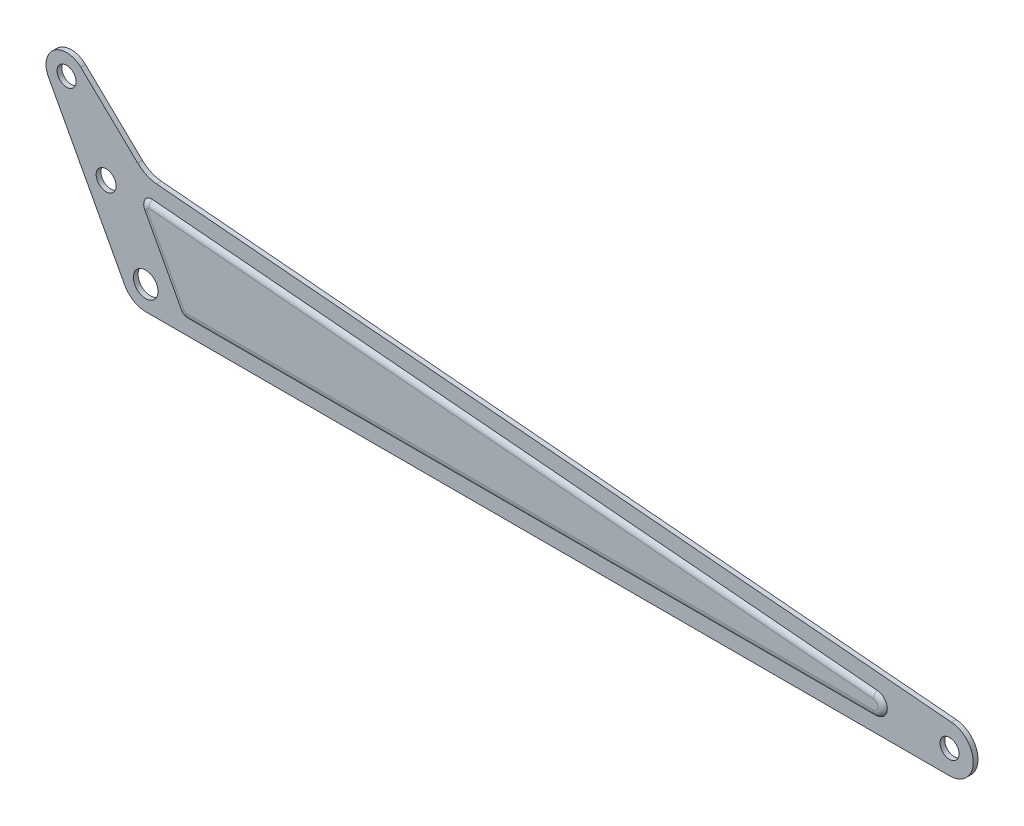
ISO-10303-21;
HEADER;
FILE_DESCRIPTION(('STEP AP214'),'2;1');
FILE_NAME('part.step','',(''),(''),'','','');
FILE_SCHEMA(('AUTOMOTIVE_DESIGN { 1 0 10303 214 1 1 1 1 }'));
ENDSEC;
DATA;
#1=APPLICATION_CONTEXT('core data for automotive mechanical design processes');
#2=APPLICATION_PROTOCOL_DEFINITION('international standard','automotive_design',2000,#1);
#3=PRODUCT_CONTEXT('',#1,'mechanical');
#4=PRODUCT('Part','Part','',(#3));
#5=PRODUCT_RELATED_PRODUCT_CATEGORY('part','',(#4));
#6=PRODUCT_DEFINITION_FORMATION('','',#4);
#7=PRODUCT_DEFINITION_CONTEXT('part definition',#1,'design');
#8=PRODUCT_DEFINITION('design','',#6,#7);
#9=PRODUCT_DEFINITION_SHAPE('','',#8);
#10=(LENGTH_UNIT() NAMED_UNIT(*) SI_UNIT(.MILLI.,.METRE.));
#11=(NAMED_UNIT(*) PLANE_ANGLE_UNIT() SI_UNIT($,.RADIAN.));
#12=(NAMED_UNIT(*) SI_UNIT($,.STERADIAN.) SOLID_ANGLE_UNIT());
#13=UNCERTAINTY_MEASURE_WITH_UNIT(LENGTH_MEASURE(1.E-05),#10,'distance_accuracy_value','');
#14=(GEOMETRIC_REPRESENTATION_CONTEXT(3) GLOBAL_UNCERTAINTY_ASSIGNED_CONTEXT((#13)) GLOBAL_UNIT_ASSIGNED_CONTEXT((#10,
#11,#12)) REPRESENTATION_CONTEXT('',''));
#15=CARTESIAN_POINT('',(0.,0.,0.));
#16=DIRECTION('',(0.,0.,1.));
#17=DIRECTION('',(1.,0.,0.));
#18=AXIS2_PLACEMENT_3D('',#15,#16,#17);
#19=CARTESIAN_POINT('',(254.,0.,1.5));
#20=DIRECTION('',(0.,0.,1.));
#21=DIRECTION('',(1.,0.,0.));
#22=AXIS2_PLACEMENT_3D('',#19,#20,#21);
#23=PLANE('',#22);
#24=CARTESIAN_POINT('',(-25.,44.4522215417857,1.5));
#25=DIRECTION('',(0.,0.,1.));
#26=DIRECTION('',(1.,0.,0.));
#27=AXIS2_PLACEMENT_3D('',#24,#25,#26);
#28=CIRCLE('',#27,3.);
#29=CARTESIAN_POINT('',(-22.,44.4522215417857,1.5));
#30=VERTEX_POINT('',#29);
#31=EDGE_CURVE('E252',#30,#30,#28,.T.);
#32=ORIENTED_EDGE('',*,*,#31,.F.);
#33=EDGE_LOOP('',(#32));
#34=FACE_BOUND('',#33,.T.);
#35=CARTESIAN_POINT('',(254.,0.,1.5));
#36=DIRECTION('',(0.,0.,1.));
#37=DIRECTION('',(1.,0.,0.));
#38=AXIS2_PLACEMENT_3D('',#35,#36,#37);
#39=CIRCLE('',#38,2.99999999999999);
#40=CARTESIAN_POINT('',(257.,0.,1.5));
#41=VERTEX_POINT('',#40);
#42=EDGE_CURVE('E264',#41,#41,#39,.T.);
#43=ORIENTED_EDGE('',*,*,#42,.F.);
#44=EDGE_LOOP('',(#43));
#45=FACE_BOUND('',#44,.T.);
#46=CARTESIAN_POINT('',(254.,0.,1.5));
#47=DIRECTION('',(0.,0.,1.));
#48=DIRECTION('',(1.,0.,0.));
#49=AXIS2_PLACEMENT_3D('',#46,#47,#48);
#50=CIRCLE('',#49,7.50000000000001);
#51=CARTESIAN_POINT('',(254.,-7.50000000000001,1.5));
#52=VERTEX_POINT('',#51);
#53=CARTESIAN_POINT('',(254.646365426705,7.47209553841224,1.5));
#54=VERTEX_POINT('',#53);
#55=EDGE_CURVE('E270',#52,#54,#50,.T.);
#56=ORIENTED_EDGE('',*,*,#55,.T.);
#57=DIRECTION('',(-0.996279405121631,0.0861820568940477,0.));
#58=VECTOR('',#57,1.);
#59=CARTESIAN_POINT('',(3.51162698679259,29.1962305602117,1.5));
#60=LINE('',#59,#58);
#61=CARTESIAN_POINT('',(3.51162698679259,29.1962305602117,1.5));
#62=VERTEX_POINT('',#61);
#63=EDGE_CURVE('E273',#54,#62,#60,.T.);
#64=ORIENTED_EDGE('',*,*,#63,.T.);
#65=CARTESIAN_POINT('',(4.37344755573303,39.159024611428,1.5));
#66=DIRECTION('',(0.,0.,-1.));
#67=DIRECTION('',(-1.,0.,0.));
#68=AXIS2_PLACEMENT_3D('',#65,#66,#67);
#69=CIRCLE('',#68,10.);
#70=CARTESIAN_POINT('',(-2.54501960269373,31.9385805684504,1.5));
#71=VERTEX_POINT('',#70);
#72=EDGE_CURVE('E276',#62,#71,#69,.T.);
#73=ORIENTED_EDGE('',*,*,#72,.T.);
#74=DIRECTION('',(-0.722044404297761,0.691846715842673,0.));
#75=VECTOR('',#74,1.);
#76=CARTESIAN_POINT('',(-2.54501960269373,31.9385805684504,1.5));
#77=LINE('',#76,#75);
#78=CARTESIAN_POINT('',(-20.5029963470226,49.1455101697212,1.5));
#79=VERTEX_POINT('',#78);
#80=EDGE_CURVE('E278',#71,#79,#77,.T.);
#81=ORIENTED_EDGE('',*,*,#80,.T.);
#82=CARTESIAN_POINT('',(-25.,44.4522215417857,1.5));
#83=DIRECTION('',(0.,0.,1.));
#84=DIRECTION('',(1.,0.,0.));
#85=AXIS2_PLACEMENT_3D('',#82,#83,#84);
#86=CIRCLE('',#85,6.50000000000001);
#87=CARTESIAN_POINT('',(-30.7268659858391,41.3776474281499,1.5));
#88=VERTEX_POINT('',#87);
#89=EDGE_CURVE('E280',#79,#88,#86,.T.);
#90=ORIENTED_EDGE('',*,*,#89,.T.);
#91=DIRECTION('',(0.473011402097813,-0.881056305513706,0.));
#92=VECTOR('',#91,1.);
#93=CARTESIAN_POINT('',(-6.6079222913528,-3.5475855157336,1.5));
#94=LINE('',#93,#92);
#95=CARTESIAN_POINT('',(-6.6079222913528,-3.5475855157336,1.5));
#96=VERTEX_POINT('',#95);
#97=EDGE_CURVE('E282',#88,#96,#94,.T.);
#98=ORIENTED_EDGE('',*,*,#97,.T.);
#99=CARTESIAN_POINT('',(0.,0.,1.5));
#100=DIRECTION('',(0.,0.,1.));
#101=DIRECTION('',(1.,0.,0.));
#102=AXIS2_PLACEMENT_3D('',#99,#100,#101);
#103=CIRCLE('',#102,7.5);
#104=CARTESIAN_POINT('',(0.,-7.5,1.5));
#105=VERTEX_POINT('',#104);
#106=EDGE_CURVE('E284',#96,#105,#103,.T.);
#107=ORIENTED_EDGE('',*,*,#106,.T.);
#108=DIRECTION('',(1.,0.,0.));
#109=VECTOR('',#108,1.);
#110=CARTESIAN_POINT('',(0.,-7.5,1.5));
#111=LINE('',#110,#109);
#112=EDGE_CURVE('E286',#105,#52,#111,.T.);
#113=ORIENTED_EDGE('',*,*,#112,.T.);
#114=EDGE_LOOP('',(#56,#64,#73,#81,#90,#98,#107,#113));
#115=FACE_BOUND('',#114,.T.);
#116=CARTESIAN_POINT('',(0.,0.,1.5));
#117=DIRECTION('',(0.,0.,1.));
#118=DIRECTION('',(1.,0.,0.));
#119=AXIS2_PLACEMENT_3D('',#116,#117,#118);
#120=CIRCLE('',#119,3.9);
#121=CARTESIAN_POINT('',(3.9,0.,1.5));
#122=VERTEX_POINT('',#121);
#123=EDGE_CURVE('E258',#122,#122,#120,.T.);
#124=ORIENTED_EDGE('',*,*,#123,.F.);
#125=EDGE_LOOP('',(#124));
#126=FACE_BOUND('',#125,.T.);
#127=CARTESIAN_POINT('',(-12.5,22.2261107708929,1.5));
#128=DIRECTION('',(0.,0.,1.));
#129=DIRECTION('',(1.,0.,0.));
#130=AXIS2_PLACEMENT_3D('',#127,#128,#129);
#131=CIRCLE('',#130,3.15);
#132=CARTESIAN_POINT('',(-9.35,22.2261107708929,1.5));
#133=VERTEX_POINT('',#132);
#134=EDGE_CURVE('E246',#133,#133,#131,.T.);
#135=ORIENTED_EDGE('',*,*,#134,.F.);
#136=EDGE_LOOP('',(#135));
#137=FACE_BOUND('',#136,.T.);
#138=DIRECTION('',(-0.996279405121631,0.0861820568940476,0.));
#139=VECTOR('',#138,1.);
#140=CARTESIAN_POINT('',(231.138121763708,4.48697791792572,1.5));
#141=LINE('',#140,#139);
#142=CARTESIAN_POINT('',(231.138121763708,4.48697791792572,1.5));
#143=VERTEX_POINT('',#142);
#144=CARTESIAN_POINT('',(2.12823103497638,24.2972272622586,1.5));
#145=VERTEX_POINT('',#144);
#146=EDGE_CURVE('E230',#143,#145,#141,.T.);
#147=ORIENTED_EDGE('',*,*,#146,.F.);
#148=CARTESIAN_POINT('',(230.83648456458,0.999999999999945,1.5));
#149=DIRECTION('',(0.,0.,1.));
#150=DIRECTION('',(1.,0.,0.));
#151=AXIS2_PLACEMENT_3D('',#148,#149,#150);
#152=CIRCLE('',#151,3.49999999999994);
#153=CARTESIAN_POINT('',(230.836484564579,-2.49999999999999,1.5));
#154=VERTEX_POINT('',#153);
#155=EDGE_CURVE('E227',#154,#143,#152,.T.);
#156=ORIENTED_EDGE('',*,*,#155,.F.);
#157=DIRECTION('',(1.,0.,0.));
#158=VECTOR('',#157,1.);
#159=CARTESIAN_POINT('',(13.6200148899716,-2.50000000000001,1.5));
#160=LINE('',#159,#158);
#161=CARTESIAN_POINT('',(13.6200148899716,-2.50000000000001,1.5));
#162=VERTEX_POINT('',#161);
#163=EDGE_CURVE('E242',#162,#154,#160,.T.);
#164=ORIENTED_EDGE('',*,*,#163,.F.);
#165=CARTESIAN_POINT('',(13.6200148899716,0.,1.5));
#166=DIRECTION('',(0.,0.,1.));
#167=DIRECTION('',(-1.,0.,0.));
#168=AXIS2_PLACEMENT_3D('',#165,#166,#167);
#169=CIRCLE('',#168,2.5);
#170=CARTESIAN_POINT('',(11.4173741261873,-1.18252850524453,1.5));
#171=VERTEX_POINT('',#170);
#172=EDGE_CURVE('E239',#171,#162,#169,.T.);
#173=ORIENTED_EDGE('',*,*,#172,.F.);
#174=DIRECTION('',(0.473011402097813,-0.881056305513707,0.));
#175=VECTOR('',#174,1.);
#176=CARTESIAN_POINT('',(-0.28986487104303,20.62400024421,1.5));
#177=LINE('',#176,#175);
#178=CARTESIAN_POINT('',(-0.28986487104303,20.62400024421,1.5));
#179=VERTEX_POINT('',#178);
#180=EDGE_CURVE('E236',#179,#171,#177,.T.);
#181=ORIENTED_EDGE('',*,*,#180,.F.);
#182=CARTESIAN_POINT('',(1.91277589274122,21.8065287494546,1.5));
#183=DIRECTION('',(0.,0.,1.));
#184=DIRECTION('',(-1.,0.,0.));
#185=AXIS2_PLACEMENT_3D('',#182,#183,#184);
#186=CIRCLE('',#185,2.5);
#187=EDGE_CURVE('E233',#145,#179,#186,.T.);
#188=ORIENTED_EDGE('',*,*,#187,.F.);
#189=EDGE_LOOP('',(#147,#156,#164,#173,#181,#188));
#190=FACE_BOUND('',#189,.T.);
#191=ADVANCED_FACE('F32',(#34,#45,#115,#126,#137,#190),#23,.T.);
#192=CARTESIAN_POINT('',(254.,0.,0.));
#193=DIRECTION('',(0.,0.,1.));
#194=DIRECTION('',(1.,0.,0.));
#195=AXIS2_PLACEMENT_3D('',#192,#193,#194);
#196=PLANE('',#195);
#197=CARTESIAN_POINT('',(1.91277589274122,21.8065287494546,0.));
#198=DIRECTION('',(0.,0.,-1.));
#199=DIRECTION('',(-1.,0.,0.));
#200=AXIS2_PLACEMENT_3D('',#197,#198,#199);
#201=CIRCLE('',#200,1.5);
#202=CARTESIAN_POINT('',(2.04204897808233,23.300947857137,0.));
#203=VERTEX_POINT('',#202);
#204=CARTESIAN_POINT('',(0.591191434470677,21.0970116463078,0.));
#205=VERTEX_POINT('',#204);
#206=EDGE_CURVE('E181',#203,#205,#201,.F.);
#207=ORIENTED_EDGE('',*,*,#206,.T.);
#208=DIRECTION('',(0.473011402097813,-0.881056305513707,0.));
#209=VECTOR('',#208,1.);
#210=CARTESIAN_POINT('',(0.591191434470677,21.0970116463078,0.));
#211=LINE('',#210,#209);
#212=CARTESIAN_POINT('',(12.298430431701,-0.70951710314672,0.));
#213=VERTEX_POINT('',#212);
#214=EDGE_CURVE('E205',#205,#213,#211,.T.);
#215=ORIENTED_EDGE('',*,*,#214,.T.);
#216=CARTESIAN_POINT('',(13.6200148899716,0.,0.));
#217=DIRECTION('',(0.,0.,-1.));
#218=DIRECTION('',(-1.,0.,0.));
#219=AXIS2_PLACEMENT_3D('',#216,#217,#218);
#220=CIRCLE('',#219,1.5);
#221=CARTESIAN_POINT('',(13.6200148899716,-1.50000000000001,0.));
#222=VERTEX_POINT('',#221);
#223=EDGE_CURVE('E203',#213,#222,#220,.F.);
#224=ORIENTED_EDGE('',*,*,#223,.T.);
#225=DIRECTION('',(1.,0.,0.));
#226=VECTOR('',#225,1.);
#227=CARTESIAN_POINT('',(13.6200148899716,-1.50000000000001,0.));
#228=LINE('',#227,#226);
#229=CARTESIAN_POINT('',(230.836484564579,-1.5,0.));
#230=VERTEX_POINT('',#229);
#231=EDGE_CURVE('E196',#222,#230,#228,.T.);
#232=ORIENTED_EDGE('',*,*,#231,.T.);
#233=CARTESIAN_POINT('',(230.83648456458,0.999999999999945,0.));
#234=DIRECTION('',(0.,0.,-1.));
#235=DIRECTION('',(-1.,0.,0.));
#236=AXIS2_PLACEMENT_3D('',#233,#234,#235);
#237=CIRCLE('',#236,2.49999999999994);
#238=CARTESIAN_POINT('',(231.051939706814,3.49069851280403,0.));
#239=VERTEX_POINT('',#238);
#240=EDGE_CURVE('E182',#230,#239,#237,.F.);
#241=ORIENTED_EDGE('',*,*,#240,.T.);
#242=DIRECTION('',(-0.996279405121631,0.0861820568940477,0.));
#243=VECTOR('',#242,1.);
#244=CARTESIAN_POINT('',(231.051939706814,3.49069851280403,0.));
#245=LINE('',#244,#243);
#246=EDGE_CURVE('E171',#239,#203,#245,.T.);
#247=ORIENTED_EDGE('',*,*,#246,.T.);
#248=EDGE_LOOP('',(#207,#215,#224,#232,#241,#247));
#249=FACE_BOUND('',#248,.T.);
#250=CARTESIAN_POINT('',(254.,0.,0.));
#251=DIRECTION('',(0.,0.,1.));
#252=DIRECTION('',(1.,0.,0.));
#253=AXIS2_PLACEMENT_3D('',#250,#251,#252);
#254=CIRCLE('',#253,7.50000000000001);
#255=CARTESIAN_POINT('',(254.,-7.50000000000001,0.));
#256=VERTEX_POINT('',#255);
#257=CARTESIAN_POINT('',(254.646365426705,7.47209553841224,0.));
#258=VERTEX_POINT('',#257);
#259=EDGE_CURVE('E267',#256,#258,#254,.T.);
#260=ORIENTED_EDGE('',*,*,#259,.F.);
#261=DIRECTION('',(1.,0.,0.));
#262=VECTOR('',#261,1.);
#263=CARTESIAN_POINT('',(0.,-7.5,0.));
#264=LINE('',#263,#262);
#265=CARTESIAN_POINT('',(0.,-7.5,0.));
#266=VERTEX_POINT('',#265);
#267=EDGE_CURVE('E274',#266,#256,#264,.T.);
#268=ORIENTED_EDGE('',*,*,#267,.F.);
#269=CARTESIAN_POINT('',(0.,0.,0.));
#270=DIRECTION('',(0.,0.,1.));
#271=DIRECTION('',(1.,0.,0.));
#272=AXIS2_PLACEMENT_3D('',#269,#270,#271);
#273=CIRCLE('',#272,7.5);
#274=CARTESIAN_POINT('',(-6.6079222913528,-3.5475855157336,0.));
#275=VERTEX_POINT('',#274);
#276=EDGE_CURVE('E301',#275,#266,#273,.T.);
#277=ORIENTED_EDGE('',*,*,#276,.F.);
#278=DIRECTION('',(0.473011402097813,-0.881056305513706,0.));
#279=VECTOR('',#278,1.);
#280=CARTESIAN_POINT('',(-6.6079222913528,-3.5475855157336,0.));
#281=LINE('',#280,#279);
#282=CARTESIAN_POINT('',(-30.7268659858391,41.3776474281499,0.));
#283=VERTEX_POINT('',#282);
#284=EDGE_CURVE('E299',#283,#275,#281,.T.);
#285=ORIENTED_EDGE('',*,*,#284,.F.);
#286=CARTESIAN_POINT('',(-25.,44.4522215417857,0.));
#287=DIRECTION('',(0.,0.,1.));
#288=DIRECTION('',(1.,0.,0.));
#289=AXIS2_PLACEMENT_3D('',#286,#287,#288);
#290=CIRCLE('',#289,6.50000000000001);
#291=CARTESIAN_POINT('',(-20.5029963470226,49.1455101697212,0.));
#292=VERTEX_POINT('',#291);
#293=EDGE_CURVE('E297',#292,#283,#290,.T.);
#294=ORIENTED_EDGE('',*,*,#293,.F.);
#295=DIRECTION('',(-0.722044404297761,0.691846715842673,0.));
#296=VECTOR('',#295,1.);
#297=CARTESIAN_POINT('',(-2.54501960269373,31.9385805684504,0.));
#298=LINE('',#297,#296);
#299=CARTESIAN_POINT('',(-2.54501960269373,31.9385805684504,0.));
#300=VERTEX_POINT('',#299);
#301=EDGE_CURVE('E295',#300,#292,#298,.T.);
#302=ORIENTED_EDGE('',*,*,#301,.F.);
#303=CARTESIAN_POINT('',(4.37344755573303,39.159024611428,0.));
#304=DIRECTION('',(0.,0.,-1.));
#305=DIRECTION('',(-1.,0.,0.));
#306=AXIS2_PLACEMENT_3D('',#303,#304,#305);
#307=CIRCLE('',#306,10.);
#308=CARTESIAN_POINT('',(3.51162698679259,29.1962305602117,0.));
#309=VERTEX_POINT('',#308);
#310=EDGE_CURVE('E293',#309,#300,#307,.T.);
#311=ORIENTED_EDGE('',*,*,#310,.F.);
#312=DIRECTION('',(-0.996279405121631,0.0861820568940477,0.));
#313=VECTOR('',#312,1.);
#314=CARTESIAN_POINT('',(3.51162698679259,29.1962305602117,0.));
#315=LINE('',#314,#313);
#316=EDGE_CURVE('E291',#258,#309,#315,.T.);
#317=ORIENTED_EDGE('',*,*,#316,.F.);
#318=EDGE_LOOP('',(#260,#268,#277,#285,#294,#302,#311,#317));
#319=FACE_BOUND('',#318,.T.);
#320=CARTESIAN_POINT('',(254.,0.,0.));
#321=DIRECTION('',(0.,0.,1.));
#322=DIRECTION('',(1.,0.,0.));
#323=AXIS2_PLACEMENT_3D('',#320,#321,#322);
#324=CIRCLE('',#323,2.99999999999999);
#325=CARTESIAN_POINT('',(257.,0.,0.));
#326=VERTEX_POINT('',#325);
#327=EDGE_CURVE('E261',#326,#326,#324,.T.);
#328=ORIENTED_EDGE('',*,*,#327,.T.);
#329=EDGE_LOOP('',(#328));
#330=FACE_BOUND('',#329,.T.);
#331=CARTESIAN_POINT('',(0.,0.,0.));
#332=DIRECTION('',(0.,0.,1.));
#333=DIRECTION('',(1.,0.,0.));
#334=AXIS2_PLACEMENT_3D('',#331,#332,#333);
#335=CIRCLE('',#334,3.9);
#336=CARTESIAN_POINT('',(3.9,0.,0.));
#337=VERTEX_POINT('',#336);
#338=EDGE_CURVE('E255',#337,#337,#335,.T.);
#339=ORIENTED_EDGE('',*,*,#338,.T.);
#340=EDGE_LOOP('',(#339));
#341=FACE_BOUND('',#340,.T.);
#342=CARTESIAN_POINT('',(-25.,44.4522215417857,0.));
#343=DIRECTION('',(0.,0.,1.));
#344=DIRECTION('',(1.,0.,0.));
#345=AXIS2_PLACEMENT_3D('',#342,#343,#344);
#346=CIRCLE('',#345,3.);
#347=CARTESIAN_POINT('',(-22.,44.4522215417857,0.));
#348=VERTEX_POINT('',#347);
#349=EDGE_CURVE('E249',#348,#348,#346,.T.);
#350=ORIENTED_EDGE('',*,*,#349,.T.);
#351=EDGE_LOOP('',(#350));
#352=FACE_BOUND('',#351,.T.);
#353=CARTESIAN_POINT('',(-12.5,22.2261107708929,0.));
#354=DIRECTION('',(0.,0.,1.));
#355=DIRECTION('',(1.,0.,0.));
#356=AXIS2_PLACEMENT_3D('',#353,#354,#355);
#357=CIRCLE('',#356,3.15);
#358=CARTESIAN_POINT('',(-9.35,22.2261107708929,0.));
#359=VERTEX_POINT('',#358);
#360=EDGE_CURVE('E245',#359,#359,#357,.T.);
#361=ORIENTED_EDGE('',*,*,#360,.T.);
#362=EDGE_LOOP('',(#361));
#363=FACE_BOUND('',#362,.T.);
#364=ADVANCED_FACE('F193',(#249,#319,#330,#341,#352,#363),#196,.F.);
#365=CARTESIAN_POINT('',(254.,0.,1.5));
#366=DIRECTION('',(0.,0.,-1.));
#367=DIRECTION('',(-1.,0.,0.));
#368=AXIS2_PLACEMENT_3D('',#365,#366,#367);
#369=CYLINDRICAL_SURFACE('',#368,7.50000000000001);
#370=ORIENTED_EDGE('',*,*,#259,.T.);
#371=DIRECTION('',(0.,0.,-1.));
#372=VECTOR('',#371,1.);
#373=CARTESIAN_POINT('',(254.646365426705,7.47209553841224,1.5));
#374=LINE('',#373,#372);
#375=EDGE_CURVE('E324',#54,#258,#374,.T.);
#376=ORIENTED_EDGE('',*,*,#375,.F.);
#377=ORIENTED_EDGE('',*,*,#55,.F.);
#378=DIRECTION('',(0.,0.,-1.));
#379=VECTOR('',#378,1.);
#380=CARTESIAN_POINT('',(254.,-7.50000000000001,1.5));
#381=LINE('',#380,#379);
#382=EDGE_CURVE('E288',#52,#256,#381,.T.);
#383=ORIENTED_EDGE('',*,*,#382,.T.);
#384=EDGE_LOOP('',(#370,#376,#377,#383));
#385=FACE_BOUND('',#384,.T.);
#386=ADVANCED_FACE('F386',(#385),#369,.T.);
#387=CARTESIAN_POINT('',(3.51162698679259,29.1962305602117,1.5));
#388=DIRECTION('',(-0.0861820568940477,-0.996279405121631,0.));
#389=DIRECTION('',(0.996279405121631,-0.0861820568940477,0.));
#390=AXIS2_PLACEMENT_3D('',#387,#388,#389);
#391=PLANE('',#390);
#392=ORIENTED_EDGE('',*,*,#316,.T.);
#393=DIRECTION('',(0.,0.,-1.));
#394=VECTOR('',#393,1.);
#395=CARTESIAN_POINT('',(3.51162698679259,29.1962305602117,1.5));
#396=LINE('',#395,#394);
#397=EDGE_CURVE('E321',#62,#309,#396,.T.);
#398=ORIENTED_EDGE('',*,*,#397,.F.);
#399=ORIENTED_EDGE('',*,*,#63,.F.);
#400=ORIENTED_EDGE('',*,*,#375,.T.);
#401=EDGE_LOOP('',(#392,#398,#399,#400));
#402=FACE_BOUND('',#401,.T.);
#403=ADVANCED_FACE('F417',(#402),#391,.F.);
#404=CARTESIAN_POINT('',(4.37344755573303,39.159024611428,1.5));
#405=DIRECTION('',(0.,0.,-1.));
#406=DIRECTION('',(-1.,0.,0.));
#407=AXIS2_PLACEMENT_3D('',#404,#405,#406);
#408=CYLINDRICAL_SURFACE('',#407,10.);
#409=ORIENTED_EDGE('',*,*,#310,.T.);
#410=DIRECTION('',(0.,0.,-1.));
#411=VECTOR('',#410,1.);
#412=CARTESIAN_POINT('',(-2.54501960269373,31.9385805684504,1.5));
#413=LINE('',#412,#411);
#414=EDGE_CURVE('E318',#71,#300,#413,.T.);
#415=ORIENTED_EDGE('',*,*,#414,.F.);
#416=ORIENTED_EDGE('',*,*,#72,.F.);
#417=ORIENTED_EDGE('',*,*,#397,.T.);
#418=EDGE_LOOP('',(#409,#415,#416,#417));
#419=FACE_BOUND('',#418,.T.);
#420=ADVANCED_FACE('F413',(#419),#408,.F.);
#421=CARTESIAN_POINT('',(-2.54501960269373,31.9385805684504,1.5));
#422=DIRECTION('',(-0.691846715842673,-0.72204440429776,0.));
#423=DIRECTION('',(0.722044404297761,-0.691846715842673,0.));
#424=AXIS2_PLACEMENT_3D('',#421,#422,#423);
#425=PLANE('',#424);
#426=ORIENTED_EDGE('',*,*,#301,.T.);
#427=DIRECTION('',(0.,0.,-1.));
#428=VECTOR('',#427,1.);
#429=CARTESIAN_POINT('',(-20.5029963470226,49.1455101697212,1.5));
#430=LINE('',#429,#428);
#431=EDGE_CURVE('E315',#79,#292,#430,.T.);
#432=ORIENTED_EDGE('',*,*,#431,.F.);
#433=ORIENTED_EDGE('',*,*,#80,.F.);
#434=ORIENTED_EDGE('',*,*,#414,.T.);
#435=EDGE_LOOP('',(#426,#432,#433,#434));
#436=FACE_BOUND('',#435,.T.);
#437=ADVANCED_FACE('F409',(#436),#425,.F.);
#438=CARTESIAN_POINT('',(-25.,44.4522215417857,1.5));
#439=DIRECTION('',(0.,0.,-1.));
#440=DIRECTION('',(-1.,0.,0.));
#441=AXIS2_PLACEMENT_3D('',#438,#439,#440);
#442=CYLINDRICAL_SURFACE('',#441,6.50000000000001);
#443=ORIENTED_EDGE('',*,*,#293,.T.);
#444=DIRECTION('',(0.,0.,-1.));
#445=VECTOR('',#444,1.);
#446=CARTESIAN_POINT('',(-30.7268659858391,41.3776474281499,1.5));
#447=LINE('',#446,#445);
#448=EDGE_CURVE('E312',#88,#283,#447,.T.);
#449=ORIENTED_EDGE('',*,*,#448,.F.);
#450=ORIENTED_EDGE('',*,*,#89,.F.);
#451=ORIENTED_EDGE('',*,*,#431,.T.);
#452=EDGE_LOOP('',(#443,#449,#450,#451));
#453=FACE_BOUND('',#452,.T.);
#454=ADVANCED_FACE('F405',(#453),#442,.T.);
#455=CARTESIAN_POINT('',(-6.6079222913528,-3.5475855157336,1.5));
#456=DIRECTION('',(0.881056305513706,0.473011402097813,0.));
#457=DIRECTION('',(-0.473011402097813,0.881056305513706,0.));
#458=AXIS2_PLACEMENT_3D('',#455,#456,#457);
#459=PLANE('',#458);
#460=ORIENTED_EDGE('',*,*,#284,.T.);
#461=DIRECTION('',(0.,0.,-1.));
#462=VECTOR('',#461,1.);
#463=CARTESIAN_POINT('',(-6.6079222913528,-3.5475855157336,1.5));
#464=LINE('',#463,#462);
#465=EDGE_CURVE('E309',#96,#275,#464,.T.);
#466=ORIENTED_EDGE('',*,*,#465,.F.);
#467=ORIENTED_EDGE('',*,*,#97,.F.);
#468=ORIENTED_EDGE('',*,*,#448,.T.);
#469=EDGE_LOOP('',(#460,#466,#467,#468));
#470=FACE_BOUND('',#469,.T.);
#471=ADVANCED_FACE('F401',(#470),#459,.F.);
#472=CARTESIAN_POINT('',(0.,0.,1.5));
#473=DIRECTION('',(0.,0.,-1.));
#474=DIRECTION('',(-1.,0.,0.));
#475=AXIS2_PLACEMENT_3D('',#472,#473,#474);
#476=CYLINDRICAL_SURFACE('',#475,7.5);
#477=ORIENTED_EDGE('',*,*,#276,.T.);
#478=DIRECTION('',(0.,0.,-1.));
#479=VECTOR('',#478,1.);
#480=CARTESIAN_POINT('',(0.,-7.5,1.5));
#481=LINE('',#480,#479);
#482=EDGE_CURVE('E306',#105,#266,#481,.T.);
#483=ORIENTED_EDGE('',*,*,#482,.F.);
#484=ORIENTED_EDGE('',*,*,#106,.F.);
#485=ORIENTED_EDGE('',*,*,#465,.T.);
#486=EDGE_LOOP('',(#477,#483,#484,#485));
#487=FACE_BOUND('',#486,.T.);
#488=ADVANCED_FACE('F397',(#487),#476,.T.);
#489=CARTESIAN_POINT('',(0.,-7.5,1.5));
#490=DIRECTION('',(0.,1.,0.));
#491=DIRECTION('',(-1.,0.,0.));
#492=AXIS2_PLACEMENT_3D('',#489,#490,#491);
#493=PLANE('',#492);
#494=ORIENTED_EDGE('',*,*,#267,.T.);
#495=ORIENTED_EDGE('',*,*,#382,.F.);
#496=ORIENTED_EDGE('',*,*,#112,.F.);
#497=ORIENTED_EDGE('',*,*,#482,.T.);
#498=EDGE_LOOP('',(#494,#495,#496,#497));
#499=FACE_BOUND('',#498,.T.);
#500=ADVANCED_FACE('F394',(#499),#493,.F.);
#501=CARTESIAN_POINT('',(254.,0.,1.5));
#502=DIRECTION('',(0.,0.,-1.));
#503=DIRECTION('',(-1.,0.,0.));
#504=AXIS2_PLACEMENT_3D('',#501,#502,#503);
#505=CYLINDRICAL_SURFACE('',#504,2.99999999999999);
#506=ORIENTED_EDGE('',*,*,#42,.T.);
#507=EDGE_LOOP('',(#506));
#508=FACE_BOUND('',#507,.T.);
#509=ORIENTED_EDGE('',*,*,#327,.F.);
#510=EDGE_LOOP('',(#509));
#511=FACE_BOUND('',#510,.T.);
#512=ADVANCED_FACE('F391',(#508,#511),#505,.F.);
#513=CARTESIAN_POINT('',(0.,0.,1.5));
#514=DIRECTION('',(0.,0.,-1.));
#515=DIRECTION('',(-1.,0.,0.));
#516=AXIS2_PLACEMENT_3D('',#513,#514,#515);
#517=CYLINDRICAL_SURFACE('',#516,3.9);
#518=ORIENTED_EDGE('',*,*,#123,.T.);
#519=EDGE_LOOP('',(#518));
#520=FACE_BOUND('',#519,.T.);
#521=ORIENTED_EDGE('',*,*,#338,.F.);
#522=EDGE_LOOP('',(#521));
#523=FACE_BOUND('',#522,.T.);
#524=ADVANCED_FACE('F467',(#520,#523),#517,.F.);
#525=CARTESIAN_POINT('',(-25.,44.4522215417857,1.5));
#526=DIRECTION('',(0.,0.,-1.));
#527=DIRECTION('',(-1.,0.,0.));
#528=AXIS2_PLACEMENT_3D('',#525,#526,#527);
#529=CYLINDRICAL_SURFACE('',#528,3.);
#530=ORIENTED_EDGE('',*,*,#31,.T.);
#531=EDGE_LOOP('',(#530));
#532=FACE_BOUND('',#531,.T.);
#533=ORIENTED_EDGE('',*,*,#349,.F.);
#534=EDGE_LOOP('',(#533));
#535=FACE_BOUND('',#534,.T.);
#536=ADVANCED_FACE('F458',(#532,#535),#529,.F.);
#537=CARTESIAN_POINT('',(-12.5,22.2261107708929,1.5));
#538=DIRECTION('',(0.,0.,-1.));
#539=DIRECTION('',(-1.,0.,0.));
#540=AXIS2_PLACEMENT_3D('',#537,#538,#539);
#541=CYLINDRICAL_SURFACE('',#540,3.15);
#542=ORIENTED_EDGE('',*,*,#134,.T.);
#543=EDGE_LOOP('',(#542));
#544=FACE_BOUND('',#543,.T.);
#545=ORIENTED_EDGE('',*,*,#360,.F.);
#546=EDGE_LOOP('',(#545));
#547=FACE_BOUND('',#546,.T.);
#548=ADVANCED_FACE('F455',(#544,#547),#541,.F.);
#549=CARTESIAN_POINT('',(230.83648456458,0.999999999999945,2.5));
#550=DIRECTION('',(0.,0.,1.));
#551=DIRECTION('',(1.,0.,0.));
#552=AXIS2_PLACEMENT_3D('',#549,#550,#551);
#553=PLANE('',#552);
#554=DIRECTION('',(0.996279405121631,-0.0861820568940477,0.));
#555=VECTOR('',#554,1.);
#556=CARTESIAN_POINT('',(1.95586692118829,22.3046684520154,2.5));
#557=LINE('',#556,#555);
#558=CARTESIAN_POINT('',(230.96575764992,2.49441910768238,2.5));
#559=VERTEX_POINT('',#558);
#560=CARTESIAN_POINT('',(1.95586692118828,22.3046684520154,2.5));
#561=VERTEX_POINT('',#560);
#562=EDGE_CURVE('E41',#559,#561,#557,.F.);
#563=ORIENTED_EDGE('',*,*,#562,.T.);
#564=CARTESIAN_POINT('',(1.91277589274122,21.8065287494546,2.5));
#565=DIRECTION('',(0.,0.,1.));
#566=DIRECTION('',(1.,0.,0.));
#567=AXIS2_PLACEMENT_3D('',#564,#565,#566);
#568=CIRCLE('',#567,0.499999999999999);
#569=CARTESIAN_POINT('',(1.47224773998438,21.5700230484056,2.5));
#570=VERTEX_POINT('',#569);
#571=EDGE_CURVE('E11',#561,#570,#568,.T.);
#572=ORIENTED_EDGE('',*,*,#571,.T.);
#573=DIRECTION('',(-0.473011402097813,0.881056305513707,0.));
#574=VECTOR('',#573,1.);
#575=CARTESIAN_POINT('',(13.1794867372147,-0.236505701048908,2.5));
#576=LINE('',#575,#574);
#577=CARTESIAN_POINT('',(13.1794867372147,-0.236505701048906,2.5));
#578=VERTEX_POINT('',#577);
#579=EDGE_CURVE('E327',#570,#578,#576,.F.);
#580=ORIENTED_EDGE('',*,*,#579,.T.);
#581=CARTESIAN_POINT('',(13.6200148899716,0.,2.5));
#582=DIRECTION('',(0.,0.,1.));
#583=DIRECTION('',(1.,0.,0.));
#584=AXIS2_PLACEMENT_3D('',#581,#582,#583);
#585=CIRCLE('',#584,0.499999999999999);
#586=CARTESIAN_POINT('',(13.6200148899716,-0.500000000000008,2.5));
#587=VERTEX_POINT('',#586);
#588=EDGE_CURVE('E329',#578,#587,#585,.T.);
#589=ORIENTED_EDGE('',*,*,#588,.T.);
#590=DIRECTION('',(-1.,0.,0.));
#591=VECTOR('',#590,1.);
#592=CARTESIAN_POINT('',(230.836484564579,-0.499999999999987,2.5));
#593=LINE('',#592,#591);
#594=CARTESIAN_POINT('',(230.836484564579,-0.499999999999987,2.5));
#595=VERTEX_POINT('',#594);
#596=EDGE_CURVE('E331',#587,#595,#593,.F.);
#597=ORIENTED_EDGE('',*,*,#596,.T.);
#598=CARTESIAN_POINT('',(230.83648456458,0.999999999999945,2.5));
#599=DIRECTION('',(0.,0.,1.));
#600=DIRECTION('',(1.,0.,0.));
#601=AXIS2_PLACEMENT_3D('',#598,#599,#600);
#602=CIRCLE('',#601,1.49999999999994);
#603=EDGE_CURVE('E333',#595,#559,#602,.T.);
#604=ORIENTED_EDGE('',*,*,#603,.T.);
#605=EDGE_LOOP('',(#563,#572,#580,#589,#597,#604));
#606=FACE_BOUND('',#605,.T.);
#607=ADVANCED_FACE('F367',(#606),#553,.T.);
#608=CARTESIAN_POINT('',(13.6200148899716,-0.500000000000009,0.));
#609=DIRECTION('',(1.,0.,0.));
#610=DIRECTION('',(0.,1.,0.));
#611=AXIS2_PLACEMENT_3D('',#608,#609,#610);
#612=CYLINDRICAL_SURFACE('',#611,2.5);
#613=CARTESIAN_POINT('',(13.6200148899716,-0.500000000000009,0.));
#614=DIRECTION('',(-1.,0.,0.));
#615=DIRECTION('',(0.,0.,1.));
#616=AXIS2_PLACEMENT_3D('',#613,#614,#615);
#617=CIRCLE('',#616,2.5);
#618=EDGE_CURVE('E344',#162,#587,#617,.T.);
#619=ORIENTED_EDGE('',*,*,#618,.F.);
#620=ORIENTED_EDGE('',*,*,#163,.T.);
#621=CARTESIAN_POINT('',(230.836484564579,-0.499999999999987,0.));
#622=DIRECTION('',(1.,0.,0.));
#623=DIRECTION('',(0.,0.,-1.));
#624=AXIS2_PLACEMENT_3D('',#621,#622,#623);
#625=CIRCLE('',#624,2.5);
#626=EDGE_CURVE('E36',#595,#154,#625,.T.);
#627=ORIENTED_EDGE('',*,*,#626,.F.);
#628=ORIENTED_EDGE('',*,*,#596,.F.);
#629=EDGE_LOOP('',(#619,#620,#627,#628));
#630=FACE_BOUND('',#629,.T.);
#631=ADVANCED_FACE('F34',(#630),#612,.T.);
#632=CARTESIAN_POINT('',(230.83648456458,0.999999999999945,0.));
#633=DIRECTION('',(0.,0.,-1.));
#634=DIRECTION('',(-1.,0.,0.));
#635=AXIS2_PLACEMENT_3D('',#632,#633,#634);
#636=DEGENERATE_TOROIDAL_SURFACE('',#635,1.49999999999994,2.5,.T.);
#637=ORIENTED_EDGE('',*,*,#626,.T.);
#638=ORIENTED_EDGE('',*,*,#155,.T.);
#639=CARTESIAN_POINT('',(230.96575764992,2.49441910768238,0.));
#640=DIRECTION('',(-0.996279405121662,0.0861820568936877,0.));
#641=DIRECTION('',(-0.0861820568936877,-0.996279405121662,0.));
#642=AXIS2_PLACEMENT_3D('',#639,#640,#641);
#643=CIRCLE('',#642,2.5);
#644=EDGE_CURVE('E342',#559,#143,#643,.T.);
#645=ORIENTED_EDGE('',*,*,#644,.F.);
#646=ORIENTED_EDGE('',*,*,#603,.F.);
#647=EDGE_LOOP('',(#637,#638,#645,#646));
#648=FACE_BOUND('',#647,.T.);
#649=ADVANCED_FACE('F353',(#648),#636,.T.);
#650=CARTESIAN_POINT('',(13.6200148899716,0.,0.));
#651=DIRECTION('',(0.,0.,-1.));
#652=DIRECTION('',(-1.,0.,0.));
#653=AXIS2_PLACEMENT_3D('',#650,#651,#652);
#654=DEGENERATE_TOROIDAL_SURFACE('',#653,0.499999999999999,2.5,.T.);
#655=ORIENTED_EDGE('',*,*,#618,.T.);
#656=ORIENTED_EDGE('',*,*,#588,.F.);
#657=CARTESIAN_POINT('',(13.1794867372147,-0.236505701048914,0.));
#658=DIRECTION('',(-0.473011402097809,0.881056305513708,0.));
#659=DIRECTION('',(-0.881056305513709,-0.473011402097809,0.));
#660=AXIS2_PLACEMENT_3D('',#657,#658,#659);
#661=CIRCLE('',#660,2.5);
#662=EDGE_CURVE('E339',#171,#578,#661,.T.);
#663=ORIENTED_EDGE('',*,*,#662,.F.);
#664=ORIENTED_EDGE('',*,*,#172,.T.);
#665=EDGE_LOOP('',(#655,#656,#663,#664));
#666=FACE_BOUND('',#665,.T.);
#667=ADVANCED_FACE('F369',(#666),#654,.T.);
#668=CARTESIAN_POINT('',(230.96575764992,2.49441910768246,0.));
#669=DIRECTION('',(-0.996279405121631,0.0861820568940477,0.));
#670=DIRECTION('',(-0.0861820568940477,-0.996279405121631,0.));
#671=AXIS2_PLACEMENT_3D('',#668,#669,#670);
#672=CYLINDRICAL_SURFACE('',#671,2.5);
#673=ORIENTED_EDGE('',*,*,#644,.T.);
#674=ORIENTED_EDGE('',*,*,#146,.T.);
#675=CARTESIAN_POINT('',(1.95586692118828,22.3046684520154,0.));
#676=DIRECTION('',(-0.996279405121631,0.0861820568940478,0.));
#677=DIRECTION('',(-0.0861820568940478,-0.996279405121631,0.));
#678=AXIS2_PLACEMENT_3D('',#675,#676,#677);
#679=CIRCLE('',#678,2.5);
#680=EDGE_CURVE('E337',#561,#145,#679,.T.);
#681=ORIENTED_EDGE('',*,*,#680,.F.);
#682=ORIENTED_EDGE('',*,*,#562,.F.);
#683=EDGE_LOOP('',(#673,#674,#681,#682));
#684=FACE_BOUND('',#683,.T.);
#685=ADVANCED_FACE('F361',(#684),#672,.T.);
#686=CARTESIAN_POINT('',(1.47224773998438,21.5700230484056,0.));
#687=DIRECTION('',(0.473011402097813,-0.881056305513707,0.));
#688=DIRECTION('',(0.881056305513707,0.473011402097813,0.));
#689=AXIS2_PLACEMENT_3D('',#686,#687,#688);
#690=CYLINDRICAL_SURFACE('',#689,2.5);
#691=ORIENTED_EDGE('',*,*,#662,.T.);
#692=ORIENTED_EDGE('',*,*,#579,.F.);
#693=CARTESIAN_POINT('',(1.47224773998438,21.5700230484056,0.));
#694=DIRECTION('',(-0.473011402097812,0.881056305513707,0.));
#695=DIRECTION('',(-0.881056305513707,-0.473011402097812,0.));
#696=AXIS2_PLACEMENT_3D('',#693,#694,#695);
#697=CIRCLE('',#696,2.5);
#698=EDGE_CURVE('E218',#179,#570,#697,.T.);
#699=ORIENTED_EDGE('',*,*,#698,.F.);
#700=ORIENTED_EDGE('',*,*,#180,.T.);
#701=EDGE_LOOP('',(#691,#692,#699,#700));
#702=FACE_BOUND('',#701,.T.);
#703=ADVANCED_FACE('F370',(#702),#690,.T.);
#704=CARTESIAN_POINT('',(1.91277589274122,21.8065287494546,0.));
#705=DIRECTION('',(0.,0.,-1.));
#706=DIRECTION('',(-1.,0.,0.));
#707=AXIS2_PLACEMENT_3D('',#704,#705,#706);
#708=DEGENERATE_TOROIDAL_SURFACE('',#707,0.499999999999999,2.5,.T.);
#709=ORIENTED_EDGE('',*,*,#680,.T.);
#710=ORIENTED_EDGE('',*,*,#187,.T.);
#711=ORIENTED_EDGE('',*,*,#698,.T.);
#712=ORIENTED_EDGE('',*,*,#571,.F.);
#713=EDGE_LOOP('',(#709,#710,#711,#712));
#714=FACE_BOUND('',#713,.T.);
#715=ADVANCED_FACE('F364',(#714),#708,.T.);
#716=CARTESIAN_POINT('',(230.83648456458,0.999999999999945,1.));
#717=DIRECTION('',(0.,0.,1.));
#718=DIRECTION('',(1.,0.,0.));
#719=AXIS2_PLACEMENT_3D('',#716,#717,#718);
#720=PLANE('',#719);
#721=DIRECTION('',(-0.996279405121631,0.0861820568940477,0.));
#722=VECTOR('',#721,1.);
#723=CARTESIAN_POINT('',(230.96575764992,2.49441910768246,1.));
#724=LINE('',#723,#722);
#725=CARTESIAN_POINT('',(230.96575764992,2.49441910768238,1.));
#726=VERTEX_POINT('',#725);
#727=CARTESIAN_POINT('',(1.95586692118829,22.3046684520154,1.));
#728=VERTEX_POINT('',#727);
#729=EDGE_CURVE('E213',#726,#728,#724,.T.);
#730=ORIENTED_EDGE('',*,*,#729,.F.);
#731=CARTESIAN_POINT('',(230.83648456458,0.999999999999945,1.));
#732=DIRECTION('',(0.,0.,-1.));
#733=DIRECTION('',(-1.,0.,0.));
#734=AXIS2_PLACEMENT_3D('',#731,#732,#733);
#735=CIRCLE('',#734,1.49999999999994);
#736=CARTESIAN_POINT('',(230.836484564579,-0.499999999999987,1.));
#737=VERTEX_POINT('',#736);
#738=EDGE_CURVE('E189',#737,#726,#735,.F.);
#739=ORIENTED_EDGE('',*,*,#738,.F.);
#740=DIRECTION('',(1.,0.,0.));
#741=VECTOR('',#740,1.);
#742=CARTESIAN_POINT('',(230.83648456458,-0.500000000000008,1.));
#743=LINE('',#742,#741);
#744=CARTESIAN_POINT('',(13.6200148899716,-0.500000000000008,1.));
#745=VERTEX_POINT('',#744);
#746=EDGE_CURVE('E210',#745,#737,#743,.T.);
#747=ORIENTED_EDGE('',*,*,#746,.F.);
#748=CARTESIAN_POINT('',(13.6200148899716,0.,1.));
#749=DIRECTION('',(0.,0.,-1.));
#750=DIRECTION('',(-1.,0.,0.));
#751=AXIS2_PLACEMENT_3D('',#748,#749,#750);
#752=CIRCLE('',#751,0.499999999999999);
#753=CARTESIAN_POINT('',(13.1794867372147,-0.236505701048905,1.));
#754=VERTEX_POINT('',#753);
#755=EDGE_CURVE('E212',#754,#745,#752,.F.);
#756=ORIENTED_EDGE('',*,*,#755,.F.);
#757=DIRECTION('',(0.473011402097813,-0.881056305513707,0.));
#758=VECTOR('',#757,1.);
#759=CARTESIAN_POINT('',(1.47224773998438,21.5700230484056,1.));
#760=LINE('',#759,#758);
#761=CARTESIAN_POINT('',(1.47224773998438,21.5700230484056,1.));
#762=VERTEX_POINT('',#761);
#763=EDGE_CURVE('E202',#762,#754,#760,.T.);
#764=ORIENTED_EDGE('',*,*,#763,.F.);
#765=CARTESIAN_POINT('',(1.91277589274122,21.8065287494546,1.));
#766=DIRECTION('',(0.,0.,-1.));
#767=DIRECTION('',(-1.,0.,0.));
#768=AXIS2_PLACEMENT_3D('',#765,#766,#767);
#769=CIRCLE('',#768,0.499999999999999);
#770=EDGE_CURVE('E215',#728,#762,#769,.F.);
#771=ORIENTED_EDGE('',*,*,#770,.F.);
#772=EDGE_LOOP('',(#730,#739,#747,#756,#764,#771));
#773=FACE_BOUND('',#772,.T.);
#774=ADVANCED_FACE('F377',(#773),#720,.F.);
#775=CARTESIAN_POINT('',(13.6200148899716,-0.500000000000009,0.));
#776=DIRECTION('',(1.,0.,0.));
#777=DIRECTION('',(0.,1.,0.));
#778=AXIS2_PLACEMENT_3D('',#775,#776,#777);
#779=CYLINDRICAL_SURFACE('',#778,1.);
#780=CARTESIAN_POINT('',(13.6200148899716,-0.500000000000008,0.));
#781=DIRECTION('',(1.,0.,0.));
#782=DIRECTION('',(0.,1.,0.));
#783=AXIS2_PLACEMENT_3D('',#780,#781,#782);
#784=CIRCLE('',#783,1.);
#785=EDGE_CURVE('E49',#222,#745,#784,.F.);
#786=ORIENTED_EDGE('',*,*,#785,.T.);
#787=ORIENTED_EDGE('',*,*,#746,.T.);
#788=CARTESIAN_POINT('',(230.836484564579,-0.5,0.));
#789=DIRECTION('',(1.,-4.87426255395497E-13,0.));
#790=DIRECTION('',(4.87426255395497E-13,1.,0.));
#791=AXIS2_PLACEMENT_3D('',#788,#789,#790);
#792=CIRCLE('',#791,1.);
#793=EDGE_CURVE('E197',#737,#230,#792,.T.);
#794=ORIENTED_EDGE('',*,*,#793,.T.);
#795=ORIENTED_EDGE('',*,*,#231,.F.);
#796=EDGE_LOOP('',(#786,#787,#794,#795));
#797=FACE_BOUND('',#796,.T.);
#798=ADVANCED_FACE('F538',(#797),#779,.F.);
#799=CARTESIAN_POINT('',(230.83648456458,0.999999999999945,0.));
#800=DIRECTION('',(0.,0.,-1.));
#801=DIRECTION('',(-1.,0.,0.));
#802=AXIS2_PLACEMENT_3D('',#799,#800,#801);
#803=TOROIDAL_SURFACE('',#802,1.49999999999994,1.);
#804=ORIENTED_EDGE('',*,*,#793,.F.);
#805=ORIENTED_EDGE('',*,*,#738,.T.);
#806=CARTESIAN_POINT('',(230.96575764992,2.4944191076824,0.));
#807=DIRECTION('',(-0.996279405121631,0.0861820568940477,0.));
#808=DIRECTION('',(-0.0861820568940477,-0.996279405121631,0.));
#809=AXIS2_PLACEMENT_3D('',#806,#807,#808);
#810=CIRCLE('',#809,1.);
#811=EDGE_CURVE('E174',#726,#239,#810,.T.);
#812=ORIENTED_EDGE('',*,*,#811,.T.);
#813=ORIENTED_EDGE('',*,*,#240,.F.);
#814=EDGE_LOOP('',(#804,#805,#812,#813));
#815=FACE_BOUND('',#814,.T.);
#816=ADVANCED_FACE('F186',(#815),#803,.F.);
#817=CARTESIAN_POINT('',(13.6200148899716,0.,0.));
#818=DIRECTION('',(0.,0.,-1.));
#819=DIRECTION('',(-1.,0.,0.));
#820=AXIS2_PLACEMENT_3D('',#817,#818,#819);
#821=DEGENERATE_TOROIDAL_SURFACE('',#820,0.499999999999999,1.,.T.);
#822=ORIENTED_EDGE('',*,*,#785,.F.);
#823=ORIENTED_EDGE('',*,*,#223,.F.);
#824=CARTESIAN_POINT('',(13.1794867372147,-0.236505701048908,0.));
#825=DIRECTION('',(0.473011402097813,-0.881056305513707,0.));
#826=DIRECTION('',(0.881056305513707,0.473011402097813,0.));
#827=AXIS2_PLACEMENT_3D('',#824,#825,#826);
#828=CIRCLE('',#827,1.);
#829=EDGE_CURVE('E190',#213,#754,#828,.F.);
#830=ORIENTED_EDGE('',*,*,#829,.T.);
#831=ORIENTED_EDGE('',*,*,#755,.T.);
#832=EDGE_LOOP('',(#822,#823,#830,#831));
#833=FACE_BOUND('',#832,.T.);
#834=ADVANCED_FACE('F557',(#833),#821,.F.);
#835=CARTESIAN_POINT('',(230.96575764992,2.49441910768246,0.));
#836=DIRECTION('',(-0.996279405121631,0.0861820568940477,0.));
#837=DIRECTION('',(-0.0861820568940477,-0.996279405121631,0.));
#838=AXIS2_PLACEMENT_3D('',#835,#836,#837);
#839=CYLINDRICAL_SURFACE('',#838,1.);
#840=ORIENTED_EDGE('',*,*,#811,.F.);
#841=ORIENTED_EDGE('',*,*,#729,.T.);
#842=CARTESIAN_POINT('',(1.95586692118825,22.3046684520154,0.));
#843=DIRECTION('',(-0.996279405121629,0.0861820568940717,0.));
#844=DIRECTION('',(-0.0861820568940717,-0.996279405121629,0.));
#845=AXIS2_PLACEMENT_3D('',#842,#843,#844);
#846=CIRCLE('',#845,1.);
#847=EDGE_CURVE('E177',#728,#203,#846,.T.);
#848=ORIENTED_EDGE('',*,*,#847,.T.);
#849=ORIENTED_EDGE('',*,*,#246,.F.);
#850=EDGE_LOOP('',(#840,#841,#848,#849));
#851=FACE_BOUND('',#850,.T.);
#852=ADVANCED_FACE('F173',(#851),#839,.F.);
#853=CARTESIAN_POINT('',(1.47224773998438,21.5700230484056,0.));
#854=DIRECTION('',(0.473011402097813,-0.881056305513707,0.));
#855=DIRECTION('',(0.881056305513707,0.473011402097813,0.));
#856=AXIS2_PLACEMENT_3D('',#853,#854,#855);
#857=CYLINDRICAL_SURFACE('',#856,1.);
#858=ORIENTED_EDGE('',*,*,#829,.F.);
#859=ORIENTED_EDGE('',*,*,#214,.F.);
#860=CARTESIAN_POINT('',(1.47224773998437,21.5700230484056,0.));
#861=DIRECTION('',(0.473011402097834,-0.881056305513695,0.));
#862=DIRECTION('',(0.881056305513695,0.473011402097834,0.));
#863=AXIS2_PLACEMENT_3D('',#860,#861,#862);
#864=CIRCLE('',#863,1.);
#865=EDGE_CURVE('E223',#205,#762,#864,.F.);
#866=ORIENTED_EDGE('',*,*,#865,.T.);
#867=ORIENTED_EDGE('',*,*,#763,.T.);
#868=EDGE_LOOP('',(#858,#859,#866,#867));
#869=FACE_BOUND('',#868,.T.);
#870=ADVANCED_FACE('F574',(#869),#857,.F.);
#871=CARTESIAN_POINT('',(1.91277589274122,21.8065287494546,0.));
#872=DIRECTION('',(0.,0.,-1.));
#873=DIRECTION('',(-1.,0.,0.));
#874=AXIS2_PLACEMENT_3D('',#871,#872,#873);
#875=DEGENERATE_TOROIDAL_SURFACE('',#874,0.499999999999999,1.,.T.);
#876=ORIENTED_EDGE('',*,*,#847,.F.);
#877=ORIENTED_EDGE('',*,*,#770,.T.);
#878=ORIENTED_EDGE('',*,*,#865,.F.);
#879=ORIENTED_EDGE('',*,*,#206,.F.);
#880=EDGE_LOOP('',(#876,#877,#878,#879));
#881=FACE_BOUND('',#880,.T.);
#882=ADVANCED_FACE('F583',(#881),#875,.F.);
#883=CLOSED_SHELL('',(#191,#364,#386,#403,#420,#437,#454,#471,#488,#500,#512,#524,#536,#548,
#607,#631,#649,#667,#685,#703,#715,#774,#798,#816,#834,#852,#870,#882));
#884=MANIFOLD_SOLID_BREP('B2',#883);
#885=ADVANCED_BREP_SHAPE_REPRESENTATION('',(#18,#884),#14);
#886=SHAPE_DEFINITION_REPRESENTATION(#9,#885);
ENDSEC;
END-ISO-10303-21;
